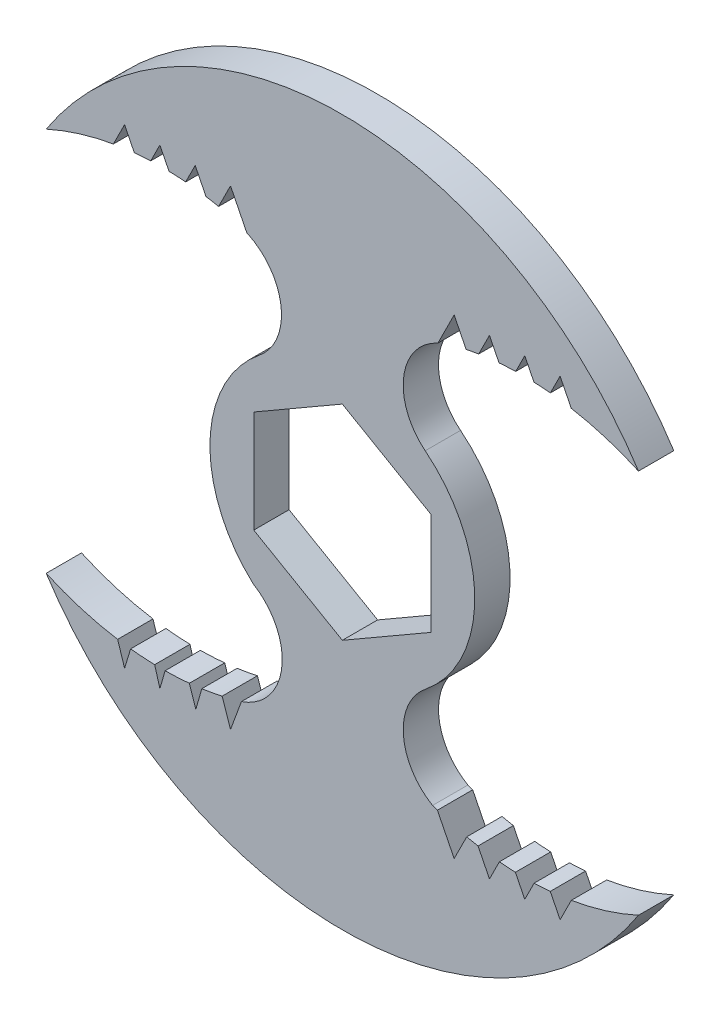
from build123d import *

# Parameters (mm, degrees)
EXTRUSION1_DEPTH = 6


with BuildPart() as part:
    # Esquisse1 → Extrusion1 (new body)
    with BuildSketch(Plane.XY):
        with BuildLine():
            ThreePointArc((-25.992491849, -36.693358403), (-28.053686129, -36.850279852), (-30.119741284, -36.917824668))
            Line((-30.119741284, -36.917824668), (-31, -40))
            Line((-31, -40), (-31.886868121, -36.904605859))
            ThreePointArc((-31.886868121, -36.904605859), (-33.932551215, -36.807484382), (-35.972186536, -36.622715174))
            Line((-35.972186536, -36.622715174), (-37, -40))
            Line((-37, -40), (-38.177718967, -36.322904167))
            ThreePointArc((-38.177718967, -36.322904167), (-44.370494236, -34.90548129), (-50.320234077, -32.678342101))
            ThreePointArc((-50.320234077, -32.678342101), (0, -60), (50.320234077, -32.678342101))
            ThreePointArc((50.320234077, -32.678342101), (44.726109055, -34.810178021), (38.902104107, -36.195791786))
            Line((38.902104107, -36.195791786), (37, -40))
            Line((37, -40), (35.329707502, -36.659415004))
            ThreePointArc((35.329707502, -36.659415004), (33.960137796, -36.7621102), (32.588108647, -36.823782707))
            Line((32.588108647, -36.823782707), (31, -40))
            Line((31, -40), (29.404358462, -36.808716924))
            ThreePointArc((29.404358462, -36.808716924), (28.045560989, -36.734934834), (26.689547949, -36.620904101))
            Line((26.689547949, -36.620904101), (25, -40))
            Line((25, -40), (23.05692733, -36.11385466))
            ThreePointArc((23.05692733, -36.11385466), (22.095185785, -35.929570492), (21.137594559, -35.724810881))
            Line((21.137594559, -35.724810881), (19, -40))
            Line((19, -40), (16.151327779, -34.302655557))
            ThreePointArc((16.151327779, -34.302655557), (15.742524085, -34.158472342), (15.33510033, -34.010434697))
            ThreePointArc((15.33510033, -34.010434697), (10.37110034, -26.107568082), (14.085161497, -17.545889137))
            ThreePointArc((14.085161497, -17.545889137), (22.49999976, 0.003283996), (14.080039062, 17.55))
            ThreePointArc((14.080039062, 17.55), (10.403198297, 26.491494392), (16.012210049, 34.366039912))
            ThreePointArc((16.012210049, 34.366039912), (16.124186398, 34.419538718), (16.236336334, 34.472672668))
            Line((16.236336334, 34.472672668), (19, 40))
            Line((19, 40), (21.029003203, 35.941993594))
            ThreePointArc((21.029003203, 35.941993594), (22.095032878, 36.148633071), (23.165486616, 36.330973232))
            Line((23.165486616, 36.330973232), (25, 40))
            Line((25, 40), (26.624488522, 36.751022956))
            ThreePointArc((26.624488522, 36.751022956), (28.037548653, 36.849399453), (29.452905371, 36.905810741))
            Line((29.452905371, 36.905810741), (31, 40))
            Line((31, 40), (32.558798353, 36.882403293))
            ThreePointArc((32.558798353, 36.882403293), (33.953059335, 36.806064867), (35.344491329, 36.688982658))
            Line((35.344491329, 36.688982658), (37, 40))
            Line((37, 40), (38.89900051, 36.201998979))
            ThreePointArc((38.89900051, 36.201998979), (44.720327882, 34.799016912), (50.320234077, 32.678342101))
            ThreePointArc((50.320234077, 32.678342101), (8.688827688, 59.367535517), (-38.844916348, 45.728245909))
            ThreePointArc((-38.844916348, 45.728245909), (-44.036823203, 40.752401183), (-48.596129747, 35.191137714))
            ThreePointArc((-48.596129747, 35.191137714), (-49.474137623, 33.945687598), (-50.320234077, 32.678342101))
            ThreePointArc((-50.320234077, 32.678342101), (-44.720327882, 34.799016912), (-38.89900051, 36.201998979))
            Line((-38.89900051, 36.201998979), (-37, 40))
            Line((-37, 40), (-35.344491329, 36.688982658))
            ThreePointArc((-35.344491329, 36.688982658), (-33.953059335, 36.806064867), (-32.558798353, 36.882403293))
            Line((-32.558798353, 36.882403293), (-31, 40))
            Line((-31, 40), (-29.452905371, 36.905810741))
            ThreePointArc((-29.452905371, 36.905810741), (-28.037548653, 36.849399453), (-26.624488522, 36.751022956))
            Line((-26.624488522, 36.751022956), (-25, 40))
            Line((-25, 40), (-23.165486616, 36.330973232))
            ThreePointArc((-23.165486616, 36.330973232), (-22.095032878, 36.148633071), (-21.029003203, 35.941993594))
            Line((-21.029003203, 35.941993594), (-19, 40))
            Line((-19, 40), (-16.236336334, 34.472672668))
            ThreePointArc((-16.236336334, 34.472672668), (-16.124186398, 34.419538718), (-16.012210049, 34.366039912))
            ThreePointArc((-16.012210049, 34.366039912), (-10.403198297, 26.491494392), (-14.080039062, 17.55))
            ThreePointArc((-14.080039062, 17.55), (-22.489864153, 0.67528539), (-15.107644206, -16.673604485))
            ThreePointArc((-15.107644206, -16.673604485), (-10.275081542, -26.471673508), (-17.14430142, -34.966944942))
            Line((-17.14430142, -34.966944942), (-19, -40))
            Line((-19, -40), (-20.431601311, -35.815139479))
            ThreePointArc((-20.431601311, -35.815139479), (-22.150198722, -36.158643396), (-23.880246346, -36.438834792))
            Line((-23.880246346, -36.438834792), (-24.89730293, -40))
            Line((-24.89730293, -40), (-25.992491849, -36.693358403))
        make_face()
        Polygon((15.05, 8.689121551), (15.05, -8.689121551), (0, -17.378243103), (-15.05, -8.689121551), (-15.05, 8.689121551), (0, 17.378243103), align=None, mode=Mode.SUBTRACT)
    extrude(amount=EXTRUSION1_DEPTH)


solid = part.part
